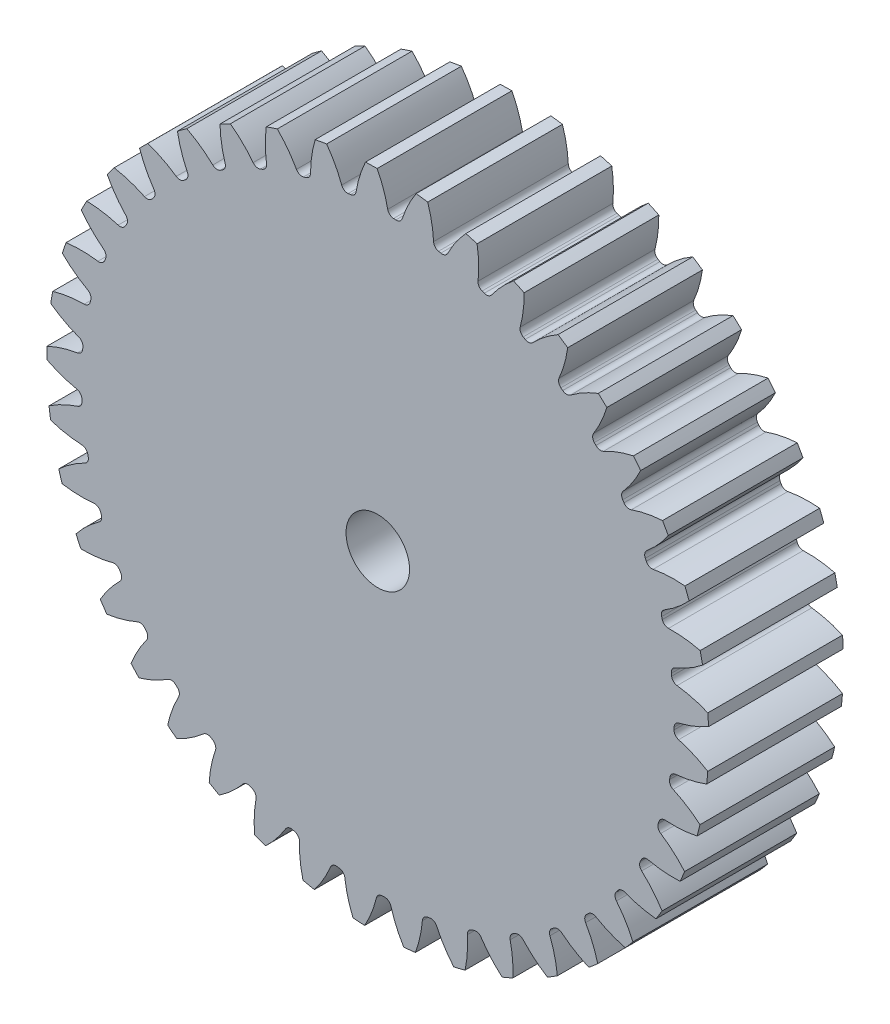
from build123d import *

# Parameters (mm, degrees)
SKETCH3_R         = 218.44
GEARBODY_DEPTH    = 88.9
TOOTHCUT_DEPTH    = 322.458048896
CIRPATTERN1_COUNT = 41
BOREDIA_R         = 20.955
BORE_DEPTH        = 12700


with BuildPart() as part:
    # Sketch3 → gearBody (new body)
    with BuildSketch(Plane.XY):
        Circle(SKETCH3_R)
    extrude(amount=GEARBODY_DEPTH)

    # Sketch2 → toothCut (cut, through all)
    with BuildSketch(Plane.XY):
        with BuildLine():
            ThreePointArc((195.529313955, -4.452390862), (195.545361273, -3.680772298), (195.558363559, -2.909096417))
            ThreePointArc((195.558363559, -2.909096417), (196.461996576, -0.389970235), (198.719048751, 1.048176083))
            ThreePointArc((198.719048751, 1.048176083), (208.854068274, 4.270202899), (218.44, 8.875633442))
            ThreePointArc((218.44, 8.875633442), (218.581523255, -4.114384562), (217.95124832, -17.089874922))
            ThreePointArc((217.95124832, -17.089874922), (208.545422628, -12.126960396), (198.538836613, -8.525805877))
            ThreePointArc((198.538836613, -8.525805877), (196.337504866, -7.003738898), (195.529313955, -4.452390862))
        make_face()
    toothcut = extrude(amount=TOOTHCUT_DEPTH, mode=Mode.SUBTRACT)

    # CirPattern1: toothCut ×41 about axis
    cirpattern1_axis = Axis((0, 0, 0), (0, 0, 1))
    for i in range(1, CIRPATTERN1_COUNT):
        add(toothcut.rotate(cirpattern1_axis, i * 360 / CIRPATTERN1_COUNT), mode=Mode.SUBTRACT)

    # boreDia → bore (cut, symmetric)
    with BuildSketch(Plane.XY):
        Circle(BOREDIA_R)
    extrude(amount=BORE_DEPTH, both=True, mode=Mode.SUBTRACT)


solid = part.part
